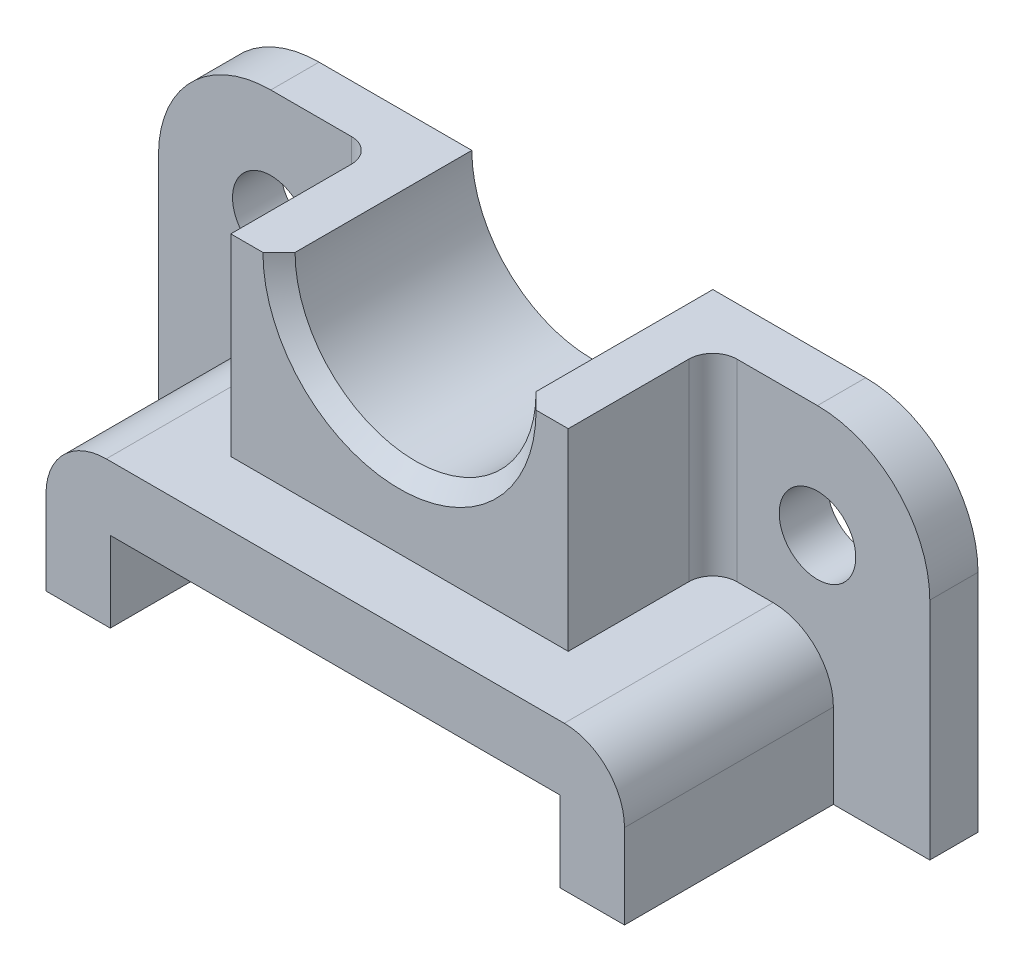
ISO-10303-21;
HEADER;
FILE_DESCRIPTION(('STEP AP214'),'2;1');
FILE_NAME('part.step','',(''),(''),'','','');
FILE_SCHEMA(('AUTOMOTIVE_DESIGN { 1 0 10303 214 1 1 1 1 }'));
ENDSEC;
DATA;
#1=APPLICATION_CONTEXT('core data for automotive mechanical design processes');
#2=APPLICATION_PROTOCOL_DEFINITION('international standard','automotive_design',2000,#1);
#3=PRODUCT_CONTEXT('',#1,'mechanical');
#4=PRODUCT('Part','Part','',(#3));
#5=PRODUCT_RELATED_PRODUCT_CATEGORY('part','',(#4));
#6=PRODUCT_DEFINITION_FORMATION('','',#4);
#7=PRODUCT_DEFINITION_CONTEXT('part definition',#1,'design');
#8=PRODUCT_DEFINITION('design','',#6,#7);
#9=PRODUCT_DEFINITION_SHAPE('','',#8);
#10=(LENGTH_UNIT() NAMED_UNIT(*) SI_UNIT(.MILLI.,.METRE.));
#11=(NAMED_UNIT(*) PLANE_ANGLE_UNIT() SI_UNIT($,.RADIAN.));
#12=(NAMED_UNIT(*) SI_UNIT($,.STERADIAN.) SOLID_ANGLE_UNIT());
#13=UNCERTAINTY_MEASURE_WITH_UNIT(LENGTH_MEASURE(1.E-05),#10,'distance_accuracy_value','');
#14=(GEOMETRIC_REPRESENTATION_CONTEXT(3) GLOBAL_UNCERTAINTY_ASSIGNED_CONTEXT((#13)) GLOBAL_UNIT_ASSIGNED_CONTEXT((#10,
#11,#12)) REPRESENTATION_CONTEXT('',''));
#15=CARTESIAN_POINT('',(0.,0.,0.));
#16=DIRECTION('',(0.,0.,1.));
#17=DIRECTION('',(1.,0.,0.));
#18=AXIS2_PLACEMENT_3D('',#15,#16,#17);
#19=CARTESIAN_POINT('',(0.,0.,6.35));
#20=DIRECTION('',(0.,1.,0.));
#21=DIRECTION('',(0.,0.,1.));
#22=AXIS2_PLACEMENT_3D('',#19,#20,#21);
#23=PLANE('',#22);
#24=DIRECTION('',(0.,0.,1.));
#25=VECTOR('',#24,1.);
#26=CARTESIAN_POINT('',(21.1666666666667,0.,2.11666666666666));
#27=LINE('',#26,#25);
#28=CARTESIAN_POINT('',(21.1666666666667,0.,2.11666666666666));
#29=VERTEX_POINT('',#28);
#30=CARTESIAN_POINT('',(21.1666666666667,0.,33.8666666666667));
#31=VERTEX_POINT('',#30);
#32=EDGE_CURVE('E202',#29,#31,#27,.T.);
#33=ORIENTED_EDGE('',*,*,#32,.T.);
#34=DIRECTION('',(1.,0.,0.));
#35=VECTOR('',#34,1.);
#36=CARTESIAN_POINT('',(12.7,0.,33.8666666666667));
#37=LINE('',#36,#35);
#38=CARTESIAN_POINT('',(12.7,0.,33.8666666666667));
#39=VERTEX_POINT('',#38);
#40=EDGE_CURVE('E280',#39,#31,#37,.T.);
#41=ORIENTED_EDGE('',*,*,#40,.F.);
#42=DIRECTION('',(0.,0.,-1.));
#43=VECTOR('',#42,1.);
#44=CARTESIAN_POINT('',(12.7,0.,33.8666666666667));
#45=LINE('',#44,#43);
#46=CARTESIAN_POINT('',(12.7,0.,6.35));
#47=VERTEX_POINT('',#46);
#48=EDGE_CURVE('E449',#39,#47,#45,.T.);
#49=ORIENTED_EDGE('',*,*,#48,.T.);
#50=DIRECTION('',(1.,0.,0.));
#51=VECTOR('',#50,1.);
#52=CARTESIAN_POINT('',(0.,0.,6.35));
#53=LINE('',#52,#51);
#54=CARTESIAN_POINT('',(0.,0.,6.35));
#55=VERTEX_POINT('',#54);
#56=EDGE_CURVE('E365',#55,#47,#53,.T.);
#57=ORIENTED_EDGE('',*,*,#56,.F.);
#58=DIRECTION('',(0.,0.,-1.));
#59=VECTOR('',#58,1.);
#60=CARTESIAN_POINT('',(0.,0.,6.35));
#61=LINE('',#60,#59);
#62=CARTESIAN_POINT('',(0.,0.,0.));
#63=VERTEX_POINT('',#62);
#64=EDGE_CURVE('E359',#55,#63,#61,.T.);
#65=ORIENTED_EDGE('',*,*,#64,.T.);
#66=DIRECTION('',(1.,0.,0.));
#67=VECTOR('',#66,1.);
#68=CARTESIAN_POINT('',(0.,0.,0.));
#69=LINE('',#68,#67);
#70=CARTESIAN_POINT('',(101.6,0.,0.));
#71=VERTEX_POINT('',#70);
#72=EDGE_CURVE('E350',#63,#71,#69,.T.);
#73=ORIENTED_EDGE('',*,*,#72,.T.);
#74=DIRECTION('',(0.,0.,-1.));
#75=VECTOR('',#74,1.);
#76=CARTESIAN_POINT('',(101.6,0.,6.35));
#77=LINE('',#76,#75);
#78=CARTESIAN_POINT('',(101.6,0.,6.35));
#79=VERTEX_POINT('',#78);
#80=EDGE_CURVE('E362',#79,#71,#77,.T.);
#81=ORIENTED_EDGE('',*,*,#80,.F.);
#82=CARTESIAN_POINT('',(88.9,0.,6.35));
#83=VERTEX_POINT('',#82);
#84=EDGE_CURVE('E368',#83,#79,#53,.T.);
#85=ORIENTED_EDGE('',*,*,#84,.F.);
#86=DIRECTION('',(0.,0.,-1.));
#87=VECTOR('',#86,1.);
#88=CARTESIAN_POINT('',(88.9,0.,33.8666666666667));
#89=LINE('',#88,#87);
#90=CARTESIAN_POINT('',(88.9,0.,33.8666666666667));
#91=VERTEX_POINT('',#90);
#92=EDGE_CURVE('E283',#91,#83,#89,.T.);
#93=ORIENTED_EDGE('',*,*,#92,.F.);
#94=CARTESIAN_POINT('',(80.4333333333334,0.,33.8666666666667));
#95=VERTEX_POINT('',#94);
#96=EDGE_CURVE('E279',#95,#91,#37,.T.);
#97=ORIENTED_EDGE('',*,*,#96,.F.);
#98=DIRECTION('',(0.,0.,1.));
#99=VECTOR('',#98,1.);
#100=CARTESIAN_POINT('',(80.4333333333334,0.,2.11666666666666));
#101=LINE('',#100,#99);
#102=CARTESIAN_POINT('',(80.4333333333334,0.,2.11666666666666));
#103=VERTEX_POINT('',#102);
#104=EDGE_CURVE('E235',#103,#95,#101,.T.);
#105=ORIENTED_EDGE('',*,*,#104,.F.);
#106=DIRECTION('',(1.,0.,0.));
#107=VECTOR('',#106,1.);
#108=CARTESIAN_POINT('',(21.1666666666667,0.,2.11666666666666));
#109=LINE('',#108,#107);
#110=EDGE_CURVE('E223',#29,#103,#109,.T.);
#111=ORIENTED_EDGE('',*,*,#110,.F.);
#112=EDGE_LOOP('',(#33,#41,#49,#57,#65,#73,#81,#85,#93,#97,#105,#111));
#113=FACE_BOUND('',#112,.T.);
#114=ADVANCED_FACE('F31',(#113),#23,.F.);
#115=CARTESIAN_POINT('',(12.7,0.,33.8666666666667));
#116=DIRECTION('',(0.,0.,-1.));
#117=DIRECTION('',(-1.,0.,0.));
#118=AXIS2_PLACEMENT_3D('',#115,#116,#117);
#119=PLANE('',#118);
#120=DIRECTION('',(0.,-1.,0.));
#121=VECTOR('',#120,1.);
#122=CARTESIAN_POINT('',(88.9,19.05,33.8666666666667));
#123=LINE('',#122,#121);
#124=CARTESIAN_POINT('',(88.9,11.1125,33.8666666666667));
#125=VERTEX_POINT('',#124);
#126=EDGE_CURVE('E277',#125,#91,#123,.T.);
#127=ORIENTED_EDGE('',*,*,#126,.F.);
#128=CARTESIAN_POINT('',(80.9625,11.1125,33.8666666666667));
#129=DIRECTION('',(0.,0.,-1.));
#130=DIRECTION('',(-1.,0.,0.));
#131=AXIS2_PLACEMENT_3D('',#128,#129,#130);
#132=CIRCLE('',#131,7.9375);
#133=CARTESIAN_POINT('',(80.9625,19.05,33.8666666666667));
#134=VERTEX_POINT('',#133);
#135=EDGE_CURVE('E301',#125,#134,#132,.F.);
#136=ORIENTED_EDGE('',*,*,#135,.T.);
#137=DIRECTION('',(-1.,0.,0.));
#138=VECTOR('',#137,1.);
#139=CARTESIAN_POINT('',(88.9,19.05,33.8666666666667));
#140=LINE('',#139,#138);
#141=CARTESIAN_POINT('',(20.6375,19.05,33.8666666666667));
#142=VERTEX_POINT('',#141);
#143=EDGE_CURVE('E273',#134,#142,#140,.T.);
#144=ORIENTED_EDGE('',*,*,#143,.T.);
#145=CARTESIAN_POINT('',(20.6375,11.1125,33.8666666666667));
#146=DIRECTION('',(0.,0.,-1.));
#147=DIRECTION('',(-1.,0.,0.));
#148=AXIS2_PLACEMENT_3D('',#145,#146,#147);
#149=CIRCLE('',#148,7.9375);
#150=CARTESIAN_POINT('',(12.7,11.1125,33.8666666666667));
#151=VERTEX_POINT('',#150);
#152=EDGE_CURVE('E299',#142,#151,#149,.F.);
#153=ORIENTED_EDGE('',*,*,#152,.T.);
#154=DIRECTION('',(0.,1.,0.));
#155=VECTOR('',#154,1.);
#156=CARTESIAN_POINT('',(12.7,0.,33.8666666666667));
#157=LINE('',#156,#155);
#158=EDGE_CURVE('E270',#39,#151,#157,.T.);
#159=ORIENTED_EDGE('',*,*,#158,.F.);
#160=ORIENTED_EDGE('',*,*,#40,.T.);
#161=DIRECTION('',(0.,1.,0.));
#162=VECTOR('',#161,1.);
#163=CARTESIAN_POINT('',(21.1666666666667,0.,33.8666666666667));
#164=LINE('',#163,#162);
#165=CARTESIAN_POINT('',(21.1666666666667,10.5833333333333,33.8666666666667));
#166=VERTEX_POINT('',#165);
#167=EDGE_CURVE('E228',#31,#166,#164,.T.);
#168=ORIENTED_EDGE('',*,*,#167,.T.);
#169=DIRECTION('',(-1.,0.,0.));
#170=VECTOR('',#169,1.);
#171=CARTESIAN_POINT('',(80.4333333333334,10.5833333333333,33.8666666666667));
#172=LINE('',#171,#170);
#173=CARTESIAN_POINT('',(80.4333333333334,10.5833333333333,33.8666666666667));
#174=VERTEX_POINT('',#173);
#175=EDGE_CURVE('E214',#174,#166,#172,.T.);
#176=ORIENTED_EDGE('',*,*,#175,.F.);
#177=DIRECTION('',(0.,-1.,0.));
#178=VECTOR('',#177,1.);
#179=CARTESIAN_POINT('',(80.4333333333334,10.5833333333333,33.8666666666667));
#180=LINE('',#179,#178);
#181=EDGE_CURVE('E208',#174,#95,#180,.T.);
#182=ORIENTED_EDGE('',*,*,#181,.T.);
#183=ORIENTED_EDGE('',*,*,#96,.T.);
#184=EDGE_LOOP('',(#127,#136,#144,#153,#159,#160,#168,#176,#182,#183));
#185=FACE_BOUND('',#184,.T.);
#186=ADVANCED_FACE('F467',(#185),#119,.F.);
#187=CARTESIAN_POINT('',(101.6,44.4499999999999,6.35));
#188=DIRECTION('',(0.,-1.,0.));
#189=DIRECTION('',(1.,0.,0.));
#190=AXIS2_PLACEMENT_3D('',#187,#188,#189);
#191=PLANE('',#190);
#192=DIRECTION('',(0.,0.,1.));
#193=VECTOR('',#192,1.);
#194=CARTESIAN_POINT('',(66.675,44.4499999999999,0.));
#195=LINE('',#194,#193);
#196=CARTESIAN_POINT('',(66.675,44.4499999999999,0.));
#197=VERTEX_POINT('',#196);
#198=CARTESIAN_POINT('',(66.675,44.4499999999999,23.2833333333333));
#199=VERTEX_POINT('',#198);
#200=EDGE_CURVE('E240',#197,#199,#195,.T.);
#201=ORIENTED_EDGE('',*,*,#200,.T.);
#202=DIRECTION('',(0.707106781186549,0.,0.707106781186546));
#203=VECTOR('',#202,1.);
#204=CARTESIAN_POINT('',(50.8,44.4499999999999,7.40833333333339));
#205=LINE('',#204,#203);
#206=CARTESIAN_POINT('',(68.7916666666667,44.4499999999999,25.4));
#207=VERTEX_POINT('',#206);
#208=EDGE_CURVE('E53',#199,#207,#205,.T.);
#209=ORIENTED_EDGE('',*,*,#208,.T.);
#210=DIRECTION('',(1.,0.,0.));
#211=VECTOR('',#210,1.);
#212=CARTESIAN_POINT('',(28.575,44.4499999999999,25.4));
#213=LINE('',#212,#211);
#214=CARTESIAN_POINT('',(73.025,44.4499999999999,25.4));
#215=VERTEX_POINT('',#214);
#216=EDGE_CURVE('E254',#207,#215,#213,.T.);
#217=ORIENTED_EDGE('',*,*,#216,.T.);
#218=DIRECTION('',(0.,0.,-1.));
#219=VECTOR('',#218,1.);
#220=CARTESIAN_POINT('',(73.025,44.4499999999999,25.4));
#221=LINE('',#220,#219);
#222=CARTESIAN_POINT('',(73.025,44.4499999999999,9.52500000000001));
#223=VERTEX_POINT('',#222);
#224=EDGE_CURVE('E260',#215,#223,#221,.T.);
#225=ORIENTED_EDGE('',*,*,#224,.T.);
#226=CARTESIAN_POINT('',(76.2,44.4499999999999,9.525));
#227=DIRECTION('',(0.,-1.,0.));
#228=DIRECTION('',(1.,0.,0.));
#229=AXIS2_PLACEMENT_3D('',#226,#227,#228);
#230=CIRCLE('',#229,3.175);
#231=CARTESIAN_POINT('',(76.2,44.4499999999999,6.35));
#232=VERTEX_POINT('',#231);
#233=EDGE_CURVE('E327',#223,#232,#230,.T.);
#234=ORIENTED_EDGE('',*,*,#233,.T.);
#235=DIRECTION('',(-1.,0.,0.));
#236=VECTOR('',#235,1.);
#237=CARTESIAN_POINT('',(101.6,44.4499999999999,6.35));
#238=LINE('',#237,#236);
#239=CARTESIAN_POINT('',(86.8045,44.4499999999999,6.35));
#240=VERTEX_POINT('',#239);
#241=EDGE_CURVE('E374',#240,#232,#238,.T.);
#242=ORIENTED_EDGE('',*,*,#241,.F.);
#243=DIRECTION('',(0.,0.,-1.));
#244=VECTOR('',#243,1.);
#245=CARTESIAN_POINT('',(86.8045,44.4499999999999,0.));
#246=LINE('',#245,#244);
#247=CARTESIAN_POINT('',(86.8045,44.4499999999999,0.));
#248=VERTEX_POINT('',#247);
#249=EDGE_CURVE('E345',#240,#248,#246,.T.);
#250=ORIENTED_EDGE('',*,*,#249,.T.);
#251=DIRECTION('',(-1.,0.,0.));
#252=VECTOR('',#251,1.);
#253=CARTESIAN_POINT('',(101.6,44.4499999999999,0.));
#254=LINE('',#253,#252);
#255=EDGE_CURVE('E342',#248,#197,#254,.T.);
#256=ORIENTED_EDGE('',*,*,#255,.T.);
#257=EDGE_LOOP('',(#201,#209,#217,#225,#234,#242,#250,#256));
#258=FACE_BOUND('',#257,.T.);
#259=ADVANCED_FACE('F339',(#258),#191,.F.);
#260=CARTESIAN_POINT('',(0.,0.,6.35));
#261=DIRECTION('',(0.,0.,-1.));
#262=DIRECTION('',(-1.,0.,0.));
#263=AXIS2_PLACEMENT_3D('',#260,#261,#262);
#264=PLANE('',#263);
#265=CARTESIAN_POINT('',(14.7955,29.6544999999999,6.3499999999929));
#266=DIRECTION('',(0.,0.,1.));
#267=DIRECTION('',(1.,0.,0.));
#268=AXIS2_PLACEMENT_3D('',#265,#266,#267);
#269=CIRCLE('',#268,5.04189999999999);
#270=CARTESIAN_POINT('',(19.8374,29.6544999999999,6.3499999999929));
#271=VERTEX_POINT('',#270);
#272=EDGE_CURVE('E557',#271,#271,#269,.T.);
#273=ORIENTED_EDGE('',*,*,#272,.F.);
#274=EDGE_LOOP('',(#273));
#275=FACE_BOUND('',#274,.T.);
#276=DIRECTION('',(-1.,0.,0.));
#277=VECTOR('',#276,1.);
#278=CARTESIAN_POINT('',(88.9,19.05,6.35));
#279=LINE('',#278,#277);
#280=CARTESIAN_POINT('',(25.4,19.05,6.35));
#281=VERTEX_POINT('',#280);
#282=CARTESIAN_POINT('',(20.6375,19.05,6.35));
#283=VERTEX_POINT('',#282);
#284=EDGE_CURVE('E287',#281,#283,#279,.T.);
#285=ORIENTED_EDGE('',*,*,#284,.F.);
#286=DIRECTION('',(0.,-1.,0.));
#287=VECTOR('',#286,1.);
#288=CARTESIAN_POINT('',(25.4,44.4499999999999,6.35));
#289=LINE('',#288,#287);
#290=CARTESIAN_POINT('',(25.4,44.4499999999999,6.35));
#291=VERTEX_POINT('',#290);
#292=EDGE_CURVE('E318',#281,#291,#289,.F.);
#293=ORIENTED_EDGE('',*,*,#292,.T.);
#294=CARTESIAN_POINT('',(14.7955,44.4499999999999,6.35));
#295=VERTEX_POINT('',#294);
#296=EDGE_CURVE('E376',#291,#295,#238,.T.);
#297=ORIENTED_EDGE('',*,*,#296,.T.);
#298=CARTESIAN_POINT('',(14.7955,29.6544999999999,6.35));
#299=DIRECTION('',(0.,0.,-1.));
#300=DIRECTION('',(-1.,0.,0.));
#301=AXIS2_PLACEMENT_3D('',#298,#299,#300);
#302=CIRCLE('',#301,14.7955);
#303=CARTESIAN_POINT('',(0.,29.6544999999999,6.35));
#304=VERTEX_POINT('',#303);
#305=EDGE_CURVE('E395',#295,#304,#302,.F.);
#306=ORIENTED_EDGE('',*,*,#305,.T.);
#307=DIRECTION('',(0.,1.,0.));
#308=VECTOR('',#307,1.);
#309=CARTESIAN_POINT('',(0.,0.,6.35));
#310=LINE('',#309,#308);
#311=EDGE_CURVE('E290',#55,#304,#310,.T.);
#312=ORIENTED_EDGE('',*,*,#311,.F.);
#313=ORIENTED_EDGE('',*,*,#56,.T.);
#314=DIRECTION('',(0.,1.,0.));
#315=VECTOR('',#314,1.);
#316=CARTESIAN_POINT('',(12.7,0.,6.35));
#317=LINE('',#316,#315);
#318=CARTESIAN_POINT('',(12.7,11.1125,6.35));
#319=VERTEX_POINT('',#318);
#320=EDGE_CURVE('E269',#47,#319,#317,.T.);
#321=ORIENTED_EDGE('',*,*,#320,.T.);
#322=CARTESIAN_POINT('',(20.6375,11.1125,6.35));
#323=DIRECTION('',(0.,0.,-1.));
#324=DIRECTION('',(-1.,0.,0.));
#325=AXIS2_PLACEMENT_3D('',#322,#323,#324);
#326=CIRCLE('',#325,7.9375);
#327=EDGE_CURVE('E308',#319,#283,#326,.T.);
#328=ORIENTED_EDGE('',*,*,#327,.T.);
#329=EDGE_LOOP('',(#285,#293,#297,#306,#312,#313,#321,#328));
#330=FACE_BOUND('',#329,.T.);
#331=ADVANCED_FACE('F443',(#275,#330),#264,.F.);
#332=CARTESIAN_POINT('',(86.8045,29.6544999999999,6.35));
#333=DIRECTION('',(0.,0.,1.));
#334=DIRECTION('',(1.,0.,0.));
#335=AXIS2_PLACEMENT_3D('',#332,#333,#334);
#336=CIRCLE('',#335,5.0419);
#337=CARTESIAN_POINT('',(91.8464,29.6544999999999,6.35));
#338=VERTEX_POINT('',#337);
#339=EDGE_CURVE('E561',#338,#338,#336,.T.);
#340=ORIENTED_EDGE('',*,*,#339,.F.);
#341=EDGE_LOOP('',(#340));
#342=FACE_BOUND('',#341,.T.);
#343=ORIENTED_EDGE('',*,*,#241,.T.);
#344=DIRECTION('',(0.,1.,0.));
#345=VECTOR('',#344,1.);
#346=CARTESIAN_POINT('',(76.2,19.05,6.35));
#347=LINE('',#346,#345);
#348=CARTESIAN_POINT('',(76.2,19.05,6.35));
#349=VERTEX_POINT('',#348);
#350=EDGE_CURVE('E323',#232,#349,#347,.F.);
#351=ORIENTED_EDGE('',*,*,#350,.T.);
#352=CARTESIAN_POINT('',(80.9625,19.05,6.35));
#353=VERTEX_POINT('',#352);
#354=EDGE_CURVE('E284',#353,#349,#279,.T.);
#355=ORIENTED_EDGE('',*,*,#354,.F.);
#356=CARTESIAN_POINT('',(80.9625,11.1125,6.35));
#357=DIRECTION('',(0.,0.,-1.));
#358=DIRECTION('',(-1.,0.,0.));
#359=AXIS2_PLACEMENT_3D('',#356,#357,#358);
#360=CIRCLE('',#359,7.9375);
#361=CARTESIAN_POINT('',(88.9,11.1125,6.35));
#362=VERTEX_POINT('',#361);
#363=EDGE_CURVE('E306',#353,#362,#360,.T.);
#364=ORIENTED_EDGE('',*,*,#363,.T.);
#365=DIRECTION('',(0.,-1.,0.));
#366=VECTOR('',#365,1.);
#367=CARTESIAN_POINT('',(88.9,19.05,6.35));
#368=LINE('',#367,#366);
#369=EDGE_CURVE('E274',#362,#83,#368,.T.);
#370=ORIENTED_EDGE('',*,*,#369,.T.);
#371=ORIENTED_EDGE('',*,*,#84,.T.);
#372=DIRECTION('',(0.,-1.,0.));
#373=VECTOR('',#372,1.);
#374=CARTESIAN_POINT('',(101.6,44.4499999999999,6.35));
#375=LINE('',#374,#373);
#376=CARTESIAN_POINT('',(101.6,29.6544999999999,6.35));
#377=VERTEX_POINT('',#376);
#378=EDGE_CURVE('E372',#377,#79,#375,.T.);
#379=ORIENTED_EDGE('',*,*,#378,.F.);
#380=CARTESIAN_POINT('',(86.8045,29.6544999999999,6.35));
#381=DIRECTION('',(0.,0.,-1.));
#382=DIRECTION('',(-1.,0.,0.));
#383=AXIS2_PLACEMENT_3D('',#380,#381,#382);
#384=CIRCLE('',#383,14.7955);
#385=EDGE_CURVE('E411',#377,#240,#384,.F.);
#386=ORIENTED_EDGE('',*,*,#385,.T.);
#387=EDGE_LOOP('',(#343,#351,#355,#364,#370,#371,#379,#386));
#388=FACE_BOUND('',#387,.T.);
#389=ADVANCED_FACE('F423',(#342,#388),#264,.F.);
#390=CARTESIAN_POINT('',(88.9,19.05,33.8666666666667));
#391=DIRECTION('',(0.,-1.,0.));
#392=DIRECTION('',(1.,0.,0.));
#393=AXIS2_PLACEMENT_3D('',#390,#391,#392);
#394=PLANE('',#393);
#395=DIRECTION('',(0.,0.,-1.));
#396=VECTOR('',#395,1.);
#397=CARTESIAN_POINT('',(28.575,19.05,25.4));
#398=LINE('',#397,#396);
#399=CARTESIAN_POINT('',(28.575,19.05,25.4));
#400=VERTEX_POINT('',#399);
#401=CARTESIAN_POINT('',(28.575,19.05,9.52500000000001));
#402=VERTEX_POINT('',#401);
#403=EDGE_CURVE('E266',#400,#402,#398,.T.);
#404=ORIENTED_EDGE('',*,*,#403,.T.);
#405=CARTESIAN_POINT('',(25.4,19.05,9.525));
#406=DIRECTION('',(0.,-1.,0.));
#407=DIRECTION('',(1.,0.,0.));
#408=AXIS2_PLACEMENT_3D('',#405,#406,#407);
#409=CIRCLE('',#408,3.175);
#410=EDGE_CURVE('E316',#402,#281,#409,.F.);
#411=ORIENTED_EDGE('',*,*,#410,.T.);
#412=ORIENTED_EDGE('',*,*,#284,.T.);
#413=DIRECTION('',(0.,0.,-1.));
#414=VECTOR('',#413,1.);
#415=CARTESIAN_POINT('',(20.6375,19.05,33.8666666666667));
#416=LINE('',#415,#414);
#417=EDGE_CURVE('E412',#283,#142,#416,.F.);
#418=ORIENTED_EDGE('',*,*,#417,.T.);
#419=ORIENTED_EDGE('',*,*,#143,.F.);
#420=DIRECTION('',(0.,0.,-1.));
#421=VECTOR('',#420,1.);
#422=CARTESIAN_POINT('',(80.9625,19.05,6.35));
#423=LINE('',#422,#421);
#424=EDGE_CURVE('E295',#134,#353,#423,.T.);
#425=ORIENTED_EDGE('',*,*,#424,.T.);
#426=ORIENTED_EDGE('',*,*,#354,.T.);
#427=CARTESIAN_POINT('',(76.2,19.05,9.525));
#428=DIRECTION('',(0.,-1.,0.));
#429=DIRECTION('',(1.,0.,0.));
#430=AXIS2_PLACEMENT_3D('',#427,#428,#429);
#431=CIRCLE('',#430,3.175);
#432=CARTESIAN_POINT('',(73.025,19.05,9.52500000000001));
#433=VERTEX_POINT('',#432);
#434=EDGE_CURVE('E314',#349,#433,#431,.F.);
#435=ORIENTED_EDGE('',*,*,#434,.T.);
#436=DIRECTION('',(0.,0.,-1.));
#437=VECTOR('',#436,1.);
#438=CARTESIAN_POINT('',(73.025,19.05,25.4));
#439=LINE('',#438,#437);
#440=CARTESIAN_POINT('',(73.025,19.05,25.4));
#441=VERTEX_POINT('',#440);
#442=EDGE_CURVE('E263',#441,#433,#439,.T.);
#443=ORIENTED_EDGE('',*,*,#442,.F.);
#444=DIRECTION('',(-1.,0.,0.));
#445=VECTOR('',#444,1.);
#446=CARTESIAN_POINT('',(73.025,19.05,25.4));
#447=LINE('',#446,#445);
#448=EDGE_CURVE('E248',#441,#400,#447,.T.);
#449=ORIENTED_EDGE('',*,*,#448,.T.);
#450=EDGE_LOOP('',(#404,#411,#412,#418,#419,#425,#426,#435,#443,#449));
#451=FACE_BOUND('',#450,.T.);
#452=ADVANCED_FACE('F419',(#451),#394,.F.);
#453=CARTESIAN_POINT('',(0.,0.,6.35));
#454=DIRECTION('',(-1.,0.,0.));
#455=DIRECTION('',(0.,0.,1.));
#456=AXIS2_PLACEMENT_3D('',#453,#454,#455);
#457=PLANE('',#456);
#458=ORIENTED_EDGE('',*,*,#311,.T.);
#459=DIRECTION('',(0.,0.,-1.));
#460=VECTOR('',#459,1.);
#461=CARTESIAN_POINT('',(0.,29.6544999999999,0.));
#462=LINE('',#461,#460);
#463=CARTESIAN_POINT('',(0.,29.6544999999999,0.));
#464=VERTEX_POINT('',#463);
#465=EDGE_CURVE('E361',#304,#464,#462,.T.);
#466=ORIENTED_EDGE('',*,*,#465,.T.);
#467=DIRECTION('',(0.,1.,0.));
#468=VECTOR('',#467,1.);
#469=CARTESIAN_POINT('',(0.,0.,0.));
#470=LINE('',#469,#468);
#471=EDGE_CURVE('E353',#63,#464,#470,.T.);
#472=ORIENTED_EDGE('',*,*,#471,.F.);
#473=ORIENTED_EDGE('',*,*,#64,.F.);
#474=EDGE_LOOP('',(#458,#466,#472,#473));
#475=FACE_BOUND('',#474,.T.);
#476=ADVANCED_FACE('F387',(#475),#457,.T.);
#477=CARTESIAN_POINT('',(101.6,44.4499999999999,6.35));
#478=DIRECTION('',(1.,0.,0.));
#479=DIRECTION('',(0.,1.,0.));
#480=AXIS2_PLACEMENT_3D('',#477,#478,#479);
#481=PLANE('',#480);
#482=DIRECTION('',(0.,-1.,0.));
#483=VECTOR('',#482,1.);
#484=CARTESIAN_POINT('',(101.6,44.4499999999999,0.));
#485=LINE('',#484,#483);
#486=CARTESIAN_POINT('',(101.6,29.6544999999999,0.));
#487=VERTEX_POINT('',#486);
#488=EDGE_CURVE('E347',#487,#71,#485,.T.);
#489=ORIENTED_EDGE('',*,*,#488,.F.);
#490=DIRECTION('',(0.,0.,-1.));
#491=VECTOR('',#490,1.);
#492=CARTESIAN_POINT('',(101.6,29.6544999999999,6.35));
#493=LINE('',#492,#491);
#494=EDGE_CURVE('E409',#487,#377,#493,.F.);
#495=ORIENTED_EDGE('',*,*,#494,.T.);
#496=ORIENTED_EDGE('',*,*,#378,.T.);
#497=ORIENTED_EDGE('',*,*,#80,.T.);
#498=EDGE_LOOP('',(#489,#495,#496,#497));
#499=FACE_BOUND('',#498,.T.);
#500=ADVANCED_FACE('F502',(#499),#481,.T.);
#501=CARTESIAN_POINT('',(28.575,44.4499999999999,25.4));
#502=VERTEX_POINT('',#501);
#503=CARTESIAN_POINT('',(32.8083333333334,44.4499999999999,25.4));
#504=VERTEX_POINT('',#503);
#505=EDGE_CURVE('E255',#502,#504,#213,.T.);
#506=ORIENTED_EDGE('',*,*,#505,.T.);
#507=DIRECTION('',(0.707106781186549,0.,-0.707106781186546));
#508=VECTOR('',#507,1.);
#509=CARTESIAN_POINT('',(50.8,44.4499999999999,7.40833333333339));
#510=LINE('',#509,#508);
#511=CARTESIAN_POINT('',(34.925,44.4499999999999,23.2833333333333));
#512=VERTEX_POINT('',#511);
#513=EDGE_CURVE('E11',#504,#512,#510,.T.);
#514=ORIENTED_EDGE('',*,*,#513,.T.);
#515=DIRECTION('',(0.,0.,1.));
#516=VECTOR('',#515,1.);
#517=CARTESIAN_POINT('',(34.925,44.4499999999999,0.));
#518=LINE('',#517,#516);
#519=CARTESIAN_POINT('',(34.925,44.4499999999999,0.));
#520=VERTEX_POINT('',#519);
#521=EDGE_CURVE('E241',#520,#512,#518,.T.);
#522=ORIENTED_EDGE('',*,*,#521,.F.);
#523=CARTESIAN_POINT('',(14.7955,44.4499999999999,0.));
#524=VERTEX_POINT('',#523);
#525=EDGE_CURVE('E348',#520,#524,#254,.T.);
#526=ORIENTED_EDGE('',*,*,#525,.T.);
#527=DIRECTION('',(0.,0.,-1.));
#528=VECTOR('',#527,1.);
#529=CARTESIAN_POINT('',(14.7955,44.4499999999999,6.35));
#530=LINE('',#529,#528);
#531=EDGE_CURVE('E405',#524,#295,#530,.F.);
#532=ORIENTED_EDGE('',*,*,#531,.T.);
#533=ORIENTED_EDGE('',*,*,#296,.F.);
#534=CARTESIAN_POINT('',(25.4,44.4499999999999,9.525));
#535=DIRECTION('',(0.,-1.,0.));
#536=DIRECTION('',(1.,0.,0.));
#537=AXIS2_PLACEMENT_3D('',#534,#535,#536);
#538=CIRCLE('',#537,3.175);
#539=CARTESIAN_POINT('',(28.575,44.4499999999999,9.52500000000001));
#540=VERTEX_POINT('',#539);
#541=EDGE_CURVE('E325',#291,#540,#538,.T.);
#542=ORIENTED_EDGE('',*,*,#541,.T.);
#543=DIRECTION('',(0.,0.,-1.));
#544=VECTOR('',#543,1.);
#545=CARTESIAN_POINT('',(28.575,44.4499999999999,25.4));
#546=LINE('',#545,#544);
#547=EDGE_CURVE('E257',#502,#540,#546,.T.);
#548=ORIENTED_EDGE('',*,*,#547,.F.);
#549=EDGE_LOOP('',(#506,#514,#522,#526,#532,#533,#542,#548));
#550=FACE_BOUND('',#549,.T.);
#551=ADVANCED_FACE('F445',(#550),#191,.F.);
#552=CARTESIAN_POINT('',(0.,0.,0.));
#553=DIRECTION('',(0.,0.,-1.));
#554=DIRECTION('',(-1.,0.,0.));
#555=AXIS2_PLACEMENT_3D('',#552,#553,#554);
#556=PLANE('',#555);
#557=CARTESIAN_POINT('',(14.7955,29.6544999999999,0.));
#558=DIRECTION('',(0.,0.,1.));
#559=DIRECTION('',(1.,0.,0.));
#560=AXIS2_PLACEMENT_3D('',#557,#558,#559);
#561=CIRCLE('',#560,5.04189999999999);
#562=CARTESIAN_POINT('',(19.8374,29.6544999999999,0.));
#563=VERTEX_POINT('',#562);
#564=EDGE_CURVE('E558',#563,#563,#561,.T.);
#565=ORIENTED_EDGE('',*,*,#564,.T.);
#566=EDGE_LOOP('',(#565));
#567=FACE_BOUND('',#566,.T.);
#568=CARTESIAN_POINT('',(86.8045,29.6544999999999,0.));
#569=DIRECTION('',(0.,0.,1.));
#570=DIRECTION('',(1.,0.,0.));
#571=AXIS2_PLACEMENT_3D('',#568,#569,#570);
#572=CIRCLE('',#571,5.0419);
#573=CARTESIAN_POINT('',(91.8464,29.6544999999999,0.));
#574=VERTEX_POINT('',#573);
#575=EDGE_CURVE('E230',#574,#574,#572,.T.);
#576=ORIENTED_EDGE('',*,*,#575,.T.);
#577=EDGE_LOOP('',(#576));
#578=FACE_BOUND('',#577,.T.);
#579=ORIENTED_EDGE('',*,*,#471,.T.);
#580=CARTESIAN_POINT('',(14.7955,29.6544999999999,0.));
#581=DIRECTION('',(0.,0.,-1.));
#582=DIRECTION('',(-1.,0.,0.));
#583=AXIS2_PLACEMENT_3D('',#580,#581,#582);
#584=CIRCLE('',#583,14.7955);
#585=EDGE_CURVE('E396',#464,#524,#584,.T.);
#586=ORIENTED_EDGE('',*,*,#585,.T.);
#587=ORIENTED_EDGE('',*,*,#525,.F.);
#588=CARTESIAN_POINT('',(50.8,44.4499999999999,0.));
#589=DIRECTION('',(0.,0.,1.));
#590=DIRECTION('',(1.,0.,0.));
#591=AXIS2_PLACEMENT_3D('',#588,#589,#590);
#592=CIRCLE('',#591,15.875);
#593=EDGE_CURVE('E216',#520,#197,#592,.T.);
#594=ORIENTED_EDGE('',*,*,#593,.T.);
#595=ORIENTED_EDGE('',*,*,#255,.F.);
#596=CARTESIAN_POINT('',(86.8045,29.6544999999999,0.));
#597=DIRECTION('',(0.,0.,-1.));
#598=DIRECTION('',(-1.,0.,0.));
#599=AXIS2_PLACEMENT_3D('',#596,#597,#598);
#600=CIRCLE('',#599,14.7955);
#601=EDGE_CURVE('E397',#248,#487,#600,.T.);
#602=ORIENTED_EDGE('',*,*,#601,.T.);
#603=ORIENTED_EDGE('',*,*,#488,.T.);
#604=ORIENTED_EDGE('',*,*,#72,.F.);
#605=EDGE_LOOP('',(#579,#586,#587,#594,#595,#602,#603,#604));
#606=FACE_BOUND('',#605,.T.);
#607=ADVANCED_FACE('F447',(#567,#578,#606),#556,.T.);
#608=CARTESIAN_POINT('',(12.7,0.,33.8666666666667));
#609=DIRECTION('',(-1.,0.,0.));
#610=DIRECTION('',(0.,-1.,0.));
#611=AXIS2_PLACEMENT_3D('',#608,#609,#610);
#612=PLANE('',#611);
#613=ORIENTED_EDGE('',*,*,#158,.T.);
#614=DIRECTION('',(0.,0.,-1.));
#615=VECTOR('',#614,1.);
#616=CARTESIAN_POINT('',(12.7,11.1125,6.35));
#617=LINE('',#616,#615);
#618=EDGE_CURVE('E303',#151,#319,#617,.T.);
#619=ORIENTED_EDGE('',*,*,#618,.T.);
#620=ORIENTED_EDGE('',*,*,#320,.F.);
#621=ORIENTED_EDGE('',*,*,#48,.F.);
#622=EDGE_LOOP('',(#613,#619,#620,#621));
#623=FACE_BOUND('',#622,.T.);
#624=ADVANCED_FACE('F469',(#623),#612,.T.);
#625=CARTESIAN_POINT('',(88.9,19.05,33.8666666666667));
#626=DIRECTION('',(1.,0.,0.));
#627=DIRECTION('',(0.,0.,-1.));
#628=AXIS2_PLACEMENT_3D('',#625,#626,#627);
#629=PLANE('',#628);
#630=ORIENTED_EDGE('',*,*,#369,.F.);
#631=DIRECTION('',(0.,0.,-1.));
#632=VECTOR('',#631,1.);
#633=CARTESIAN_POINT('',(88.9,11.1125,33.8666666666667));
#634=LINE('',#633,#632);
#635=EDGE_CURVE('E297',#362,#125,#634,.F.);
#636=ORIENTED_EDGE('',*,*,#635,.T.);
#637=ORIENTED_EDGE('',*,*,#126,.T.);
#638=ORIENTED_EDGE('',*,*,#92,.T.);
#639=EDGE_LOOP('',(#630,#636,#637,#638));
#640=FACE_BOUND('',#639,.T.);
#641=ADVANCED_FACE('F480',(#640),#629,.T.);
#642=CARTESIAN_POINT('',(28.575,44.4499999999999,25.4));
#643=DIRECTION('',(1.,0.,0.));
#644=DIRECTION('',(0.,1.,0.));
#645=AXIS2_PLACEMENT_3D('',#642,#643,#644);
#646=PLANE('',#645);
#647=ORIENTED_EDGE('',*,*,#547,.T.);
#648=DIRECTION('',(0.,-1.,0.));
#649=VECTOR('',#648,1.);
#650=CARTESIAN_POINT('',(28.575,19.05,9.525));
#651=LINE('',#650,#649);
#652=EDGE_CURVE('E311',#540,#402,#651,.T.);
#653=ORIENTED_EDGE('',*,*,#652,.T.);
#654=ORIENTED_EDGE('',*,*,#403,.F.);
#655=DIRECTION('',(0.,-1.,0.));
#656=VECTOR('',#655,1.);
#657=CARTESIAN_POINT('',(28.575,44.4499999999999,25.4));
#658=LINE('',#657,#656);
#659=EDGE_CURVE('E244',#502,#400,#658,.T.);
#660=ORIENTED_EDGE('',*,*,#659,.F.);
#661=EDGE_LOOP('',(#647,#653,#654,#660));
#662=FACE_BOUND('',#661,.T.);
#663=ADVANCED_FACE('F437',(#662),#646,.F.);
#664=CARTESIAN_POINT('',(73.025,19.05,25.4));
#665=DIRECTION('',(-1.,0.,0.));
#666=DIRECTION('',(0.,-1.,0.));
#667=AXIS2_PLACEMENT_3D('',#664,#665,#666);
#668=PLANE('',#667);
#669=ORIENTED_EDGE('',*,*,#442,.T.);
#670=DIRECTION('',(0.,1.,0.));
#671=VECTOR('',#670,1.);
#672=CARTESIAN_POINT('',(73.025,44.45,9.525));
#673=LINE('',#672,#671);
#674=EDGE_CURVE('E320',#433,#223,#673,.T.);
#675=ORIENTED_EDGE('',*,*,#674,.T.);
#676=ORIENTED_EDGE('',*,*,#224,.F.);
#677=DIRECTION('',(0.,1.,0.));
#678=VECTOR('',#677,1.);
#679=CARTESIAN_POINT('',(73.025,19.05,25.4));
#680=LINE('',#679,#678);
#681=EDGE_CURVE('E251',#441,#215,#680,.T.);
#682=ORIENTED_EDGE('',*,*,#681,.F.);
#683=EDGE_LOOP('',(#669,#675,#676,#682));
#684=FACE_BOUND('',#683,.T.);
#685=ADVANCED_FACE('F430',(#684),#668,.F.);
#686=CARTESIAN_POINT('',(28.575,44.4499999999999,25.4));
#687=DIRECTION('',(0.,0.,1.));
#688=DIRECTION('',(1.,0.,0.));
#689=AXIS2_PLACEMENT_3D('',#686,#687,#688);
#690=PLANE('',#689);
#691=ORIENTED_EDGE('',*,*,#216,.F.);
#692=CARTESIAN_POINT('',(50.8,44.4499999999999,25.4));
#693=DIRECTION('',(0.,0.,1.));
#694=DIRECTION('',(1.,0.,0.));
#695=AXIS2_PLACEMENT_3D('',#692,#693,#694);
#696=CIRCLE('',#695,17.9916666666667);
#697=EDGE_CURVE('E39',#207,#504,#696,.F.);
#698=ORIENTED_EDGE('',*,*,#697,.T.);
#699=ORIENTED_EDGE('',*,*,#505,.F.);
#700=ORIENTED_EDGE('',*,*,#659,.T.);
#701=ORIENTED_EDGE('',*,*,#448,.F.);
#702=ORIENTED_EDGE('',*,*,#681,.T.);
#703=EDGE_LOOP('',(#691,#698,#699,#700,#701,#702));
#704=FACE_BOUND('',#703,.T.);
#705=ADVANCED_FACE('F433',(#704),#690,.T.);
#706=CARTESIAN_POINT('',(50.8,44.4499999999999,0.));
#707=DIRECTION('',(0.,0.,1.));
#708=DIRECTION('',(1.,0.,0.));
#709=AXIS2_PLACEMENT_3D('',#706,#707,#708);
#710=CYLINDRICAL_SURFACE('',#709,15.875);
#711=ORIENTED_EDGE('',*,*,#521,.T.);
#712=CARTESIAN_POINT('',(50.8,44.4499999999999,23.2833333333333));
#713=DIRECTION('',(0.,0.,1.));
#714=DIRECTION('',(1.,0.,0.));
#715=AXIS2_PLACEMENT_3D('',#712,#713,#714);
#716=CIRCLE('',#715,15.875);
#717=EDGE_CURVE('E329',#512,#199,#716,.T.);
#718=ORIENTED_EDGE('',*,*,#717,.T.);
#719=ORIENTED_EDGE('',*,*,#200,.F.);
#720=ORIENTED_EDGE('',*,*,#593,.F.);
#721=EDGE_LOOP('',(#711,#718,#719,#720));
#722=FACE_BOUND('',#721,.T.);
#723=ADVANCED_FACE('F335',(#722),#710,.F.);
#724=CARTESIAN_POINT('',(21.1666666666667,0.,2.11666666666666));
#725=DIRECTION('',(1.,0.,0.));
#726=DIRECTION('',(0.,0.,-1.));
#727=AXIS2_PLACEMENT_3D('',#724,#725,#726);
#728=PLANE('',#727);
#729=ORIENTED_EDGE('',*,*,#167,.F.);
#730=ORIENTED_EDGE('',*,*,#32,.F.);
#731=DIRECTION('',(0.,1.,0.));
#732=VECTOR('',#731,1.);
#733=CARTESIAN_POINT('',(21.1666666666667,0.,2.11666666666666));
#734=LINE('',#733,#732);
#735=CARTESIAN_POINT('',(21.1666666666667,10.5833333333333,2.11666666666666));
#736=VERTEX_POINT('',#735);
#737=EDGE_CURVE('E196',#29,#736,#734,.T.);
#738=ORIENTED_EDGE('',*,*,#737,.T.);
#739=DIRECTION('',(0.,0.,1.));
#740=VECTOR('',#739,1.);
#741=CARTESIAN_POINT('',(21.1666666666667,10.5833333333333,2.11666666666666));
#742=LINE('',#741,#740);
#743=EDGE_CURVE('E199',#736,#166,#742,.T.);
#744=ORIENTED_EDGE('',*,*,#743,.T.);
#745=EDGE_LOOP('',(#729,#730,#738,#744));
#746=FACE_BOUND('',#745,.T.);
#747=ADVANCED_FACE('F198',(#746),#728,.T.);
#748=CARTESIAN_POINT('',(80.4333333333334,10.5833333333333,2.11666666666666));
#749=DIRECTION('',(0.,1.,0.));
#750=DIRECTION('',(-1.,0.,0.));
#751=AXIS2_PLACEMENT_3D('',#748,#749,#750);
#752=PLANE('',#751);
#753=ORIENTED_EDGE('',*,*,#175,.T.);
#754=ORIENTED_EDGE('',*,*,#743,.F.);
#755=DIRECTION('',(-1.,0.,0.));
#756=VECTOR('',#755,1.);
#757=CARTESIAN_POINT('',(80.4333333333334,10.5833333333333,2.11666666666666));
#758=LINE('',#757,#756);
#759=CARTESIAN_POINT('',(80.4333333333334,10.5833333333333,2.11666666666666));
#760=VERTEX_POINT('',#759);
#761=EDGE_CURVE('E207',#760,#736,#758,.T.);
#762=ORIENTED_EDGE('',*,*,#761,.F.);
#763=DIRECTION('',(0.,0.,1.));
#764=VECTOR('',#763,1.);
#765=CARTESIAN_POINT('',(80.4333333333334,10.5833333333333,2.11666666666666));
#766=LINE('',#765,#764);
#767=EDGE_CURVE('E217',#760,#174,#766,.T.);
#768=ORIENTED_EDGE('',*,*,#767,.T.);
#769=EDGE_LOOP('',(#753,#754,#762,#768));
#770=FACE_BOUND('',#769,.T.);
#771=ADVANCED_FACE('F212',(#770),#752,.F.);
#772=CARTESIAN_POINT('',(80.4333333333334,10.5833333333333,2.11666666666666));
#773=DIRECTION('',(-1.,0.,0.));
#774=DIRECTION('',(0.,0.,1.));
#775=AXIS2_PLACEMENT_3D('',#772,#773,#774);
#776=PLANE('',#775);
#777=ORIENTED_EDGE('',*,*,#181,.F.);
#778=ORIENTED_EDGE('',*,*,#767,.F.);
#779=DIRECTION('',(0.,-1.,0.));
#780=VECTOR('',#779,1.);
#781=CARTESIAN_POINT('',(80.4333333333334,10.5833333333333,2.11666666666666));
#782=LINE('',#781,#780);
#783=EDGE_CURVE('E221',#760,#103,#782,.T.);
#784=ORIENTED_EDGE('',*,*,#783,.T.);
#785=ORIENTED_EDGE('',*,*,#104,.T.);
#786=EDGE_LOOP('',(#777,#778,#784,#785));
#787=FACE_BOUND('',#786,.T.);
#788=ADVANCED_FACE('F528',(#787),#776,.T.);
#789=CARTESIAN_POINT('',(21.1666666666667,0.,2.11666666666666));
#790=DIRECTION('',(0.,0.,-1.));
#791=DIRECTION('',(-1.,0.,0.));
#792=AXIS2_PLACEMENT_3D('',#789,#790,#791);
#793=PLANE('',#792);
#794=ORIENTED_EDGE('',*,*,#737,.F.);
#795=ORIENTED_EDGE('',*,*,#110,.T.);
#796=ORIENTED_EDGE('',*,*,#783,.F.);
#797=ORIENTED_EDGE('',*,*,#761,.T.);
#798=EDGE_LOOP('',(#794,#795,#796,#797));
#799=FACE_BOUND('',#798,.T.);
#800=ADVANCED_FACE('F220',(#799),#793,.F.);
#801=CARTESIAN_POINT('',(86.8045,29.6544999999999,0.));
#802=DIRECTION('',(0.,0.,1.));
#803=DIRECTION('',(1.,0.,0.));
#804=AXIS2_PLACEMENT_3D('',#801,#802,#803);
#805=CYLINDRICAL_SURFACE('',#804,5.0419);
#806=ORIENTED_EDGE('',*,*,#575,.F.);
#807=EDGE_LOOP('',(#806));
#808=FACE_BOUND('',#807,.T.);
#809=ORIENTED_EDGE('',*,*,#339,.T.);
#810=EDGE_LOOP('',(#809));
#811=FACE_BOUND('',#810,.T.);
#812=ADVANCED_FACE('F515',(#808,#811),#805,.F.);
#813=CARTESIAN_POINT('',(14.7955,29.6544999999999,0.));
#814=DIRECTION('',(0.,0.,1.));
#815=DIRECTION('',(1.,0.,0.));
#816=AXIS2_PLACEMENT_3D('',#813,#814,#815);
#817=CYLINDRICAL_SURFACE('',#816,5.04189999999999);
#818=ORIENTED_EDGE('',*,*,#564,.F.);
#819=EDGE_LOOP('',(#818));
#820=FACE_BOUND('',#819,.T.);
#821=ORIENTED_EDGE('',*,*,#272,.T.);
#822=EDGE_LOOP('',(#821));
#823=FACE_BOUND('',#822,.T.);
#824=ADVANCED_FACE('F511',(#820,#823),#817,.F.);
#825=CARTESIAN_POINT('',(14.7955,29.6544999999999,6.35));
#826=DIRECTION('',(0.,0.,1.));
#827=DIRECTION('',(1.,0.,0.));
#828=AXIS2_PLACEMENT_3D('',#825,#826,#827);
#829=CYLINDRICAL_SURFACE('',#828,14.7955);
#830=ORIENTED_EDGE('',*,*,#305,.F.);
#831=ORIENTED_EDGE('',*,*,#531,.F.);
#832=ORIENTED_EDGE('',*,*,#585,.F.);
#833=ORIENTED_EDGE('',*,*,#465,.F.);
#834=EDGE_LOOP('',(#830,#831,#832,#833));
#835=FACE_BOUND('',#834,.T.);
#836=ADVANCED_FACE('F393',(#835),#829,.T.);
#837=CARTESIAN_POINT('',(86.8045,29.6544999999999,6.35));
#838=DIRECTION('',(0.,0.,1.));
#839=DIRECTION('',(1.,0.,0.));
#840=AXIS2_PLACEMENT_3D('',#837,#838,#839);
#841=CYLINDRICAL_SURFACE('',#840,14.7955);
#842=ORIENTED_EDGE('',*,*,#385,.F.);
#843=ORIENTED_EDGE('',*,*,#494,.F.);
#844=ORIENTED_EDGE('',*,*,#601,.F.);
#845=ORIENTED_EDGE('',*,*,#249,.F.);
#846=EDGE_LOOP('',(#842,#843,#844,#845));
#847=FACE_BOUND('',#846,.T.);
#848=ADVANCED_FACE('F484',(#847),#841,.T.);
#849=CARTESIAN_POINT('',(80.9625,11.1125,33.8666666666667));
#850=DIRECTION('',(0.,0.,1.));
#851=DIRECTION('',(1.,0.,0.));
#852=AXIS2_PLACEMENT_3D('',#849,#850,#851);
#853=CYLINDRICAL_SURFACE('',#852,7.9375);
#854=ORIENTED_EDGE('',*,*,#135,.F.);
#855=ORIENTED_EDGE('',*,*,#635,.F.);
#856=ORIENTED_EDGE('',*,*,#363,.F.);
#857=ORIENTED_EDGE('',*,*,#424,.F.);
#858=EDGE_LOOP('',(#854,#855,#856,#857));
#859=FACE_BOUND('',#858,.T.);
#860=ADVANCED_FACE('F482',(#859),#853,.T.);
#861=CARTESIAN_POINT('',(20.6375,11.1125,33.8666666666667));
#862=DIRECTION('',(0.,0.,1.));
#863=DIRECTION('',(1.,0.,0.));
#864=AXIS2_PLACEMENT_3D('',#861,#862,#863);
#865=CYLINDRICAL_SURFACE('',#864,7.9375);
#866=ORIENTED_EDGE('',*,*,#152,.F.);
#867=ORIENTED_EDGE('',*,*,#417,.F.);
#868=ORIENTED_EDGE('',*,*,#327,.F.);
#869=ORIENTED_EDGE('',*,*,#618,.F.);
#870=EDGE_LOOP('',(#866,#867,#868,#869));
#871=FACE_BOUND('',#870,.T.);
#872=ADVANCED_FACE('F463',(#871),#865,.T.);
#873=CARTESIAN_POINT('',(25.4,44.4499999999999,9.525));
#874=DIRECTION('',(0.,1.,0.));
#875=DIRECTION('',(-1.,0.,0.));
#876=AXIS2_PLACEMENT_3D('',#873,#874,#875);
#877=CYLINDRICAL_SURFACE('',#876,3.175);
#878=ORIENTED_EDGE('',*,*,#541,.F.);
#879=ORIENTED_EDGE('',*,*,#292,.F.);
#880=ORIENTED_EDGE('',*,*,#410,.F.);
#881=ORIENTED_EDGE('',*,*,#652,.F.);
#882=EDGE_LOOP('',(#878,#879,#880,#881));
#883=FACE_BOUND('',#882,.T.);
#884=ADVANCED_FACE('F441',(#883),#877,.F.);
#885=CARTESIAN_POINT('',(76.2,19.05,9.525));
#886=DIRECTION('',(0.,-1.,0.));
#887=DIRECTION('',(1.,0.,0.));
#888=AXIS2_PLACEMENT_3D('',#885,#886,#887);
#889=CYLINDRICAL_SURFACE('',#888,3.175);
#890=ORIENTED_EDGE('',*,*,#434,.F.);
#891=ORIENTED_EDGE('',*,*,#350,.F.);
#892=ORIENTED_EDGE('',*,*,#233,.F.);
#893=ORIENTED_EDGE('',*,*,#674,.F.);
#894=EDGE_LOOP('',(#890,#891,#892,#893));
#895=FACE_BOUND('',#894,.T.);
#896=ADVANCED_FACE('F426',(#895),#889,.F.);
#897=CARTESIAN_POINT('',(50.8,44.4499999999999,23.2833333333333));
#898=DIRECTION('',(0.,0.,1.));
#899=DIRECTION('',(1.,0.,0.));
#900=AXIS2_PLACEMENT_3D('',#897,#898,#899);
#901=CONICAL_SURFACE('',#900,15.875,0.78539816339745);
#902=ORIENTED_EDGE('',*,*,#513,.F.);
#903=ORIENTED_EDGE('',*,*,#697,.F.);
#904=ORIENTED_EDGE('',*,*,#208,.F.);
#905=ORIENTED_EDGE('',*,*,#717,.F.);
#906=EDGE_LOOP('',(#902,#903,#904,#905));
#907=FACE_BOUND('',#906,.T.);
#908=ADVANCED_FACE('F33',(#907),#901,.F.);
#909=CLOSED_SHELL('',(#114,#186,#259,#331,#389,#452,#476,#500,#551,#607,#624,#641,#663,#685,
#705,#723,#747,#771,#788,#800,#812,#824,#836,#848,#860,#872,#884,#896,#908));
#910=MANIFOLD_SOLID_BREP('B2',#909);
#911=ADVANCED_BREP_SHAPE_REPRESENTATION('',(#18,#910),#14);
#912=SHAPE_DEFINITION_REPRESENTATION(#9,#911);
ENDSEC;
END-ISO-10303-21;
